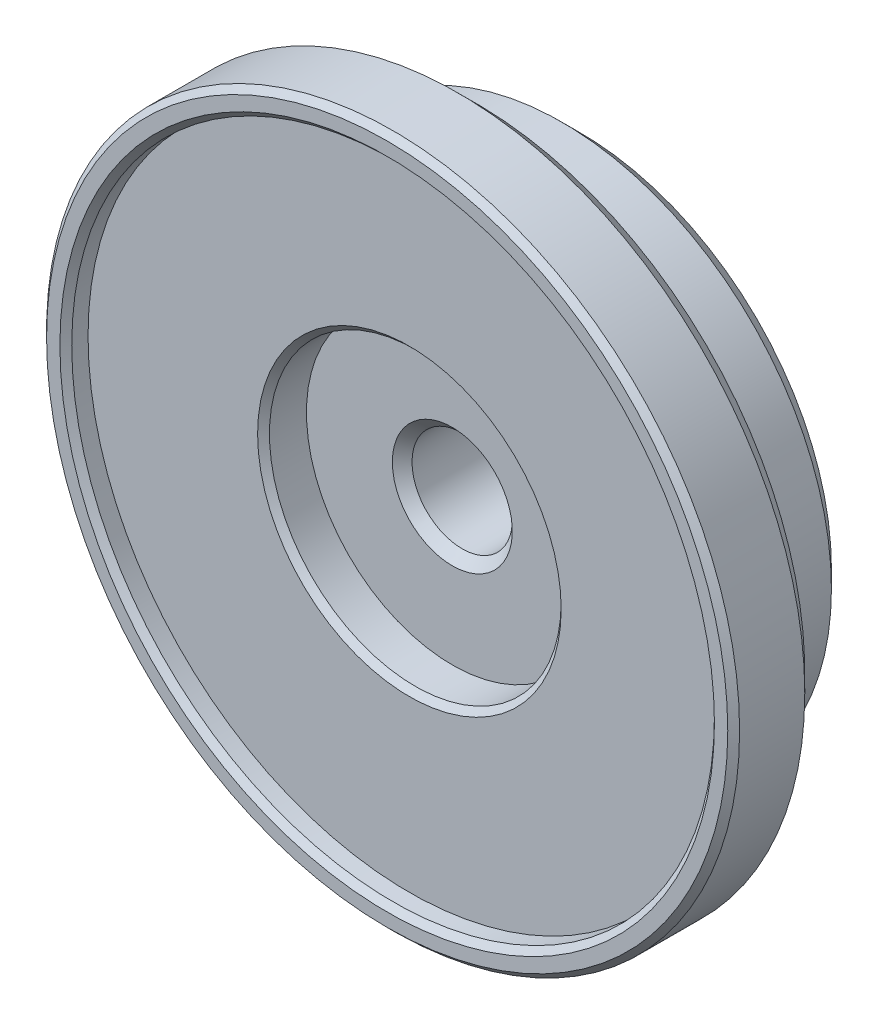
ISO-10303-21;
HEADER;
FILE_DESCRIPTION(('STEP AP214'),'2;1');
FILE_NAME('part.step','',(''),(''),'','','');
FILE_SCHEMA(('AUTOMOTIVE_DESIGN { 1 0 10303 214 1 1 1 1 }'));
ENDSEC;
DATA;
#1=APPLICATION_CONTEXT('core data for automotive mechanical design processes');
#2=APPLICATION_PROTOCOL_DEFINITION('international standard','automotive_design',2000,#1);
#3=PRODUCT_CONTEXT('',#1,'mechanical');
#4=PRODUCT('Part','Part','',(#3));
#5=PRODUCT_RELATED_PRODUCT_CATEGORY('part','',(#4));
#6=PRODUCT_DEFINITION_FORMATION('','',#4);
#7=PRODUCT_DEFINITION_CONTEXT('part definition',#1,'design');
#8=PRODUCT_DEFINITION('design','',#6,#7);
#9=PRODUCT_DEFINITION_SHAPE('','',#8);
#10=(LENGTH_UNIT() NAMED_UNIT(*) SI_UNIT(.MILLI.,.METRE.));
#11=(NAMED_UNIT(*) PLANE_ANGLE_UNIT() SI_UNIT($,.RADIAN.));
#12=(NAMED_UNIT(*) SI_UNIT($,.STERADIAN.) SOLID_ANGLE_UNIT());
#13=UNCERTAINTY_MEASURE_WITH_UNIT(LENGTH_MEASURE(1.E-05),#10,'distance_accuracy_value','');
#14=(GEOMETRIC_REPRESENTATION_CONTEXT(3) GLOBAL_UNCERTAINTY_ASSIGNED_CONTEXT((#13)) GLOBAL_UNIT_ASSIGNED_CONTEXT((#10,
#11,#12)) REPRESENTATION_CONTEXT('',''));
#15=CARTESIAN_POINT('',(0.,0.,0.));
#16=DIRECTION('',(0.,0.,1.));
#17=DIRECTION('',(1.,0.,0.));
#18=AXIS2_PLACEMENT_3D('',#15,#16,#17);
#19=CARTESIAN_POINT('',(0.,0.,-16.51));
#20=DIRECTION('',(0.,0.,1.));
#21=DIRECTION('',(1.,0.,0.));
#22=AXIS2_PLACEMENT_3D('',#19,#20,#21);
#23=CYLINDRICAL_SURFACE('',#22,29.718);
#24=CARTESIAN_POINT('',(0.,0.,-0.508000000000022));
#25=DIRECTION('',(0.,0.,1.));
#26=DIRECTION('',(1.,0.,0.));
#27=AXIS2_PLACEMENT_3D('',#24,#25,#26);
#28=CIRCLE('',#27,29.718);
#29=CARTESIAN_POINT('',(29.718,0.,-0.508000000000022));
#30=VERTEX_POINT('',#29);
#31=EDGE_CURVE('E32',#30,#30,#28,.F.);
#32=ORIENTED_EDGE('',*,*,#31,.T.);
#33=EDGE_LOOP('',(#32));
#34=FACE_BOUND('',#33,.T.);
#35=CARTESIAN_POINT('',(0.,0.,-6.09599999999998));
#36=DIRECTION('',(0.,0.,-1.));
#37=DIRECTION('',(-1.,0.,0.));
#38=AXIS2_PLACEMENT_3D('',#35,#36,#37);
#39=CIRCLE('',#38,29.718);
#40=CARTESIAN_POINT('',(-29.718,0.,-6.09599999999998));
#41=VERTEX_POINT('',#40);
#42=EDGE_CURVE('E57',#41,#41,#39,.F.);
#43=ORIENTED_EDGE('',*,*,#42,.T.);
#44=EDGE_LOOP('',(#43));
#45=FACE_BOUND('',#44,.T.);
#46=ADVANCED_FACE('F14',(#34,#45),#23,.T.);
#47=CARTESIAN_POINT('',(0.,0.,0.));
#48=DIRECTION('',(0.,0.,1.));
#49=DIRECTION('',(1.,0.,0.));
#50=AXIS2_PLACEMENT_3D('',#47,#48,#49);
#51=PLANE('',#50);
#52=CARTESIAN_POINT('',(0.,0.,0.));
#53=DIRECTION('',(0.,0.,1.));
#54=DIRECTION('',(1.,0.,0.));
#55=AXIS2_PLACEMENT_3D('',#52,#53,#54);
#56=CIRCLE('',#55,28.067);
#57=CARTESIAN_POINT('',(28.067,0.,0.));
#58=VERTEX_POINT('',#57);
#59=EDGE_CURVE('E93',#58,#58,#56,.F.);
#60=ORIENTED_EDGE('',*,*,#59,.T.);
#61=EDGE_LOOP('',(#60));
#62=FACE_BOUND('',#61,.T.);
#63=CARTESIAN_POINT('',(0.,0.,0.));
#64=DIRECTION('',(0.,0.,1.));
#65=DIRECTION('',(1.,0.,0.));
#66=AXIS2_PLACEMENT_3D('',#63,#64,#65);
#67=CIRCLE('',#66,29.21);
#68=CARTESIAN_POINT('',(29.21,0.,0.));
#69=VERTEX_POINT('',#68);
#70=EDGE_CURVE('E40',#69,#69,#67,.T.);
#71=ORIENTED_EDGE('',*,*,#70,.T.);
#72=EDGE_LOOP('',(#71));
#73=FACE_BOUND('',#72,.T.);
#74=ADVANCED_FACE('F131',(#62,#73),#51,.T.);
#75=CARTESIAN_POINT('',(0.,0.,-7.62));
#76=DIRECTION('',(0.,0.,-1.));
#77=DIRECTION('',(-1.,0.,0.));
#78=AXIS2_PLACEMENT_3D('',#75,#76,#77);
#79=PLANE('',#78);
#80=CARTESIAN_POINT('',(0.,0.,-7.62));
#81=DIRECTION('',(0.,0.,-1.));
#82=DIRECTION('',(-1.,0.,0.));
#83=AXIS2_PLACEMENT_3D('',#80,#81,#82);
#84=CIRCLE('',#83,23.876);
#85=CARTESIAN_POINT('',(-23.876,0.,-7.62));
#86=VERTEX_POINT('',#85);
#87=EDGE_CURVE('E9',#86,#86,#84,.F.);
#88=ORIENTED_EDGE('',*,*,#87,.T.);
#89=EDGE_LOOP('',(#88));
#90=FACE_BOUND('',#89,.T.);
#91=CARTESIAN_POINT('',(0.,0.,-7.62));
#92=DIRECTION('',(0.,0.,-1.));
#93=DIRECTION('',(-1.,0.,0.));
#94=AXIS2_PLACEMENT_3D('',#91,#92,#93);
#95=CIRCLE('',#94,28.194);
#96=CARTESIAN_POINT('',(-28.194,0.,-7.62));
#97=VERTEX_POINT('',#96);
#98=EDGE_CURVE('E54',#97,#97,#95,.T.);
#99=ORIENTED_EDGE('',*,*,#98,.T.);
#100=EDGE_LOOP('',(#99));
#101=FACE_BOUND('',#100,.T.);
#102=ADVANCED_FACE('F138',(#90,#101),#79,.T.);
#103=CARTESIAN_POINT('',(0.,0.,-7.62));
#104=DIRECTION('',(0.,0.,-1.));
#105=DIRECTION('',(-1.,0.,0.));
#106=AXIS2_PLACEMENT_3D('',#103,#104,#105);
#107=CYLINDRICAL_SURFACE('',#106,23.114);
#108=CARTESIAN_POINT('',(0.,0.,-8.382));
#109=DIRECTION('',(0.,0.,-1.));
#110=DIRECTION('',(-1.,0.,0.));
#111=AXIS2_PLACEMENT_3D('',#108,#109,#110);
#112=CIRCLE('',#111,23.114);
#113=CARTESIAN_POINT('',(-23.114,0.,-8.382));
#114=VERTEX_POINT('',#113);
#115=EDGE_CURVE('E22',#114,#114,#112,.T.);
#116=CARTESIAN_POINT('',(0.,0.,-14.9860000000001));
#117=DIRECTION('',(0.,0.,1.));
#118=DIRECTION('',(1.,0.,0.));
#119=AXIS2_PLACEMENT_3D('',#116,#117,#118);
#120=CIRCLE('',#119,23.114);
#121=CARTESIAN_POINT('',(-23.114,0.,-14.9860000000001));
#122=VERTEX_POINT('',#121);
#123=EDGE_CURVE('E46',#122,#122,#120,.T.);
#124=CARTESIAN_POINT('',(-23.114,0.,-8.382));
#125=CARTESIAN_POINT('',(-23.114,0.,-8.45079166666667));
#126=CARTESIAN_POINT('',(-23.114,0.,-8.51958333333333));
#127=CARTESIAN_POINT('',(-23.114,0.,-8.65716666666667));
#128=CARTESIAN_POINT('',(-23.114,0.,-8.72595833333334));
#129=CARTESIAN_POINT('',(-23.114,0.,-8.86354166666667));
#130=CARTESIAN_POINT('',(-23.114,0.,-8.93233333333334));
#131=CARTESIAN_POINT('',(-23.114,0.,-9.06991666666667));
#132=CARTESIAN_POINT('',(-23.114,0.,-9.13870833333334));
#133=CARTESIAN_POINT('',(-23.114,0.,-9.27629166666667));
#134=CARTESIAN_POINT('',(-23.114,0.,-9.34508333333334));
#135=CARTESIAN_POINT('',(-23.114,0.,-9.48266666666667));
#136=CARTESIAN_POINT('',(-23.114,0.,-9.55145833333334));
#137=CARTESIAN_POINT('',(-23.114,0.,-9.68904166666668));
#138=CARTESIAN_POINT('',(-23.114,0.,-9.75783333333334));
#139=CARTESIAN_POINT('',(-23.114,0.,-9.89541666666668));
#140=CARTESIAN_POINT('',(-23.114,0.,-9.96420833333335));
#141=CARTESIAN_POINT('',(-23.114,0.,-10.1017916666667));
#142=CARTESIAN_POINT('',(-23.114,0.,-10.1705833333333));
#143=CARTESIAN_POINT('',(-23.114,0.,-10.3081666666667));
#144=CARTESIAN_POINT('',(-23.114,0.,-10.3769583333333));
#145=CARTESIAN_POINT('',(-23.114,0.,-10.5145416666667));
#146=CARTESIAN_POINT('',(-23.114,0.,-10.5833333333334));
#147=CARTESIAN_POINT('',(-23.114,0.,-10.7209166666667));
#148=CARTESIAN_POINT('',(-23.114,0.,-10.7897083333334));
#149=CARTESIAN_POINT('',(-23.114,0.,-10.9272916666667));
#150=CARTESIAN_POINT('',(-23.114,0.,-10.9960833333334));
#151=CARTESIAN_POINT('',(-23.114,0.,-11.1336666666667));
#152=CARTESIAN_POINT('',(-23.114,0.,-11.2024583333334));
#153=CARTESIAN_POINT('',(-23.114,0.,-11.3400416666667));
#154=CARTESIAN_POINT('',(-23.114,0.,-11.4088333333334));
#155=CARTESIAN_POINT('',(-23.114,0.,-11.5464166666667));
#156=CARTESIAN_POINT('',(-23.114,0.,-11.6152083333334));
#157=CARTESIAN_POINT('',(-23.114,0.,-11.7527916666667));
#158=CARTESIAN_POINT('',(-23.114,0.,-11.8215833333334));
#159=CARTESIAN_POINT('',(-23.114,0.,-11.9591666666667));
#160=CARTESIAN_POINT('',(-23.114,0.,-12.0279583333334));
#161=CARTESIAN_POINT('',(-23.114,0.,-12.1655416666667));
#162=CARTESIAN_POINT('',(-23.114,0.,-12.2343333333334));
#163=CARTESIAN_POINT('',(-23.114,0.,-12.3719166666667));
#164=CARTESIAN_POINT('',(-23.114,0.,-12.4407083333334));
#165=CARTESIAN_POINT('',(-23.114,0.,-12.5782916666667));
#166=CARTESIAN_POINT('',(-23.114,0.,-12.6470833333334));
#167=CARTESIAN_POINT('',(-23.114,0.,-12.7846666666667));
#168=CARTESIAN_POINT('',(-23.114,0.,-12.8534583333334));
#169=CARTESIAN_POINT('',(-23.114,0.,-12.9910416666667));
#170=CARTESIAN_POINT('',(-23.114,0.,-13.0598333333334));
#171=CARTESIAN_POINT('',(-23.114,0.,-13.1974166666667));
#172=CARTESIAN_POINT('',(-23.114,0.,-13.2662083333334));
#173=CARTESIAN_POINT('',(-23.114,0.,-13.4037916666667));
#174=CARTESIAN_POINT('',(-23.114,0.,-13.4725833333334));
#175=CARTESIAN_POINT('',(-23.114,0.,-13.6101666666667));
#176=CARTESIAN_POINT('',(-23.114,0.,-13.6789583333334));
#177=CARTESIAN_POINT('',(-23.114,0.,-13.8165416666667));
#178=CARTESIAN_POINT('',(-23.114,0.,-13.8853333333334));
#179=CARTESIAN_POINT('',(-23.114,0.,-14.0229166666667));
#180=CARTESIAN_POINT('',(-23.114,0.,-14.0917083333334));
#181=CARTESIAN_POINT('',(-23.114,0.,-14.2292916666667));
#182=CARTESIAN_POINT('',(-23.114,0.,-14.2980833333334));
#183=CARTESIAN_POINT('',(-23.114,0.,-14.4356666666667));
#184=CARTESIAN_POINT('',(-23.114,0.,-14.5044583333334));
#185=CARTESIAN_POINT('',(-23.114,0.,-14.6420416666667));
#186=CARTESIAN_POINT('',(-23.114,0.,-14.7108333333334));
#187=CARTESIAN_POINT('',(-23.114,0.,-14.8484166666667));
#188=CARTESIAN_POINT('',(-23.114,0.,-14.9172083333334));
#189=CARTESIAN_POINT('',(-23.114,0.,-14.9860000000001));
#190=B_SPLINE_CURVE_WITH_KNOTS('',3,(#124,#125,#126,#127,#128,#129,#130,#131,#132,#133,#134,
#135,#136,#137,#138,#139,#140,#141,#142,#143,#144,#145,#146,#147,#148,#149,#150,#151,#152,#153,
#154,#155,#156,#157,#158,#159,#160,#161,#162,#163,#164,#165,#166,#167,#168,#169,#170,#171,#172,
#173,#174,#175,#176,#177,#178,#179,#180,#181,#182,#183,#184,#185,#186,#187,#188,#189),
.UNSPECIFIED.,.F.,.F.,(4,2,2,2,2,2,2,2,2,2,2,2,2,2,2,2,2,2,2,2,2,2,2,2,2,2,2,2,2,2,2,2,4),(0.,
0.206375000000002,0.412750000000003,0.619125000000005,0.825500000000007,1.03187500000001,
1.23825000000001,1.44462500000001,1.65100000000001,1.85737500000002,2.06375000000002,
2.27012500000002,2.47650000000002,2.68287500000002,2.88925000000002,3.09562500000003,
3.30200000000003,3.50837500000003,3.71475000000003,3.92112500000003,4.12750000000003,
4.33387500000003,4.54025000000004,4.74662500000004,4.95300000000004,5.15937500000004,
5.36575000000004,5.57212500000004,5.77850000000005,5.98487500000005,6.19125000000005,
6.39762500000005,6.60400000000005),.UNSPECIFIED.);
#191=EDGE_CURVE('BSEAM111',#114,#122,#190,.T.);
#192=ORIENTED_EDGE('',*,*,#115,.T.);
#193=ORIENTED_EDGE('',*,*,#123,.T.);
#194=ORIENTED_EDGE('',*,*,#191,.T.);
#195=ORIENTED_EDGE('',*,*,#191,.F.);
#196=EDGE_LOOP('',(#192,#194,#193,#195));
#197=FACE_BOUND('',#196,.T.);
#198=ADVANCED_FACE('F111',(#197),#107,.T.);
#199=CARTESIAN_POINT('',(0.,0.,-16.51));
#200=DIRECTION('',(0.,0.,1.));
#201=DIRECTION('',(1.,0.,0.));
#202=AXIS2_PLACEMENT_3D('',#199,#200,#201);
#203=PLANE('',#202);
#204=CARTESIAN_POINT('',(0.,0.,-16.51));
#205=DIRECTION('',(0.,0.,-1.));
#206=DIRECTION('',(-1.,0.,0.));
#207=AXIS2_PLACEMENT_3D('',#204,#205,#206);
#208=CIRCLE('',#207,5.1435);
#209=CARTESIAN_POINT('',(-5.1435,0.,-16.51));
#210=VERTEX_POINT('',#209);
#211=EDGE_CURVE('E97',#210,#210,#208,.T.);
#212=ORIENTED_EDGE('',*,*,#211,.F.);
#213=EDGE_LOOP('',(#212));
#214=FACE_BOUND('',#213,.T.);
#215=CARTESIAN_POINT('',(0.,0.,-16.51));
#216=DIRECTION('',(0.,0.,1.));
#217=DIRECTION('',(1.,0.,0.));
#218=AXIS2_PLACEMENT_3D('',#215,#216,#217);
#219=CIRCLE('',#218,21.59);
#220=CARTESIAN_POINT('',(21.59,0.,-16.51));
#221=VERTEX_POINT('',#220);
#222=EDGE_CURVE('E50',#221,#221,#219,.F.);
#223=ORIENTED_EDGE('',*,*,#222,.T.);
#224=EDGE_LOOP('',(#223));
#225=FACE_BOUND('',#224,.T.);
#226=ADVANCED_FACE('F107',(#214,#225),#203,.F.);
#227=CARTESIAN_POINT('',(0.,0.,-6.09599999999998));
#228=DIRECTION('',(0.,0.,1.));
#229=DIRECTION('',(1.,0.,0.));
#230=AXIS2_PLACEMENT_3D('',#227,#228,#229);
#231=CONICAL_SURFACE('',#230,29.718,0.785398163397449);
#232=ORIENTED_EDGE('',*,*,#98,.F.);
#233=EDGE_LOOP('',(#232));
#234=FACE_BOUND('',#233,.T.);
#235=ORIENTED_EDGE('',*,*,#42,.F.);
#236=EDGE_LOOP('',(#235));
#237=FACE_BOUND('',#236,.T.);
#238=ADVANCED_FACE('F110',(#234,#237),#231,.T.);
#239=CARTESIAN_POINT('',(0.,0.,-16.51));
#240=DIRECTION('',(0.,0.,1.));
#241=DIRECTION('',(1.,0.,0.));
#242=AXIS2_PLACEMENT_3D('',#239,#240,#241);
#243=CONICAL_SURFACE('',#242,21.59,0.785398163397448);
#244=ORIENTED_EDGE('',*,*,#123,.F.);
#245=EDGE_LOOP('',(#244));
#246=FACE_BOUND('',#245,.T.);
#247=ORIENTED_EDGE('',*,*,#222,.F.);
#248=EDGE_LOOP('',(#247));
#249=FACE_BOUND('',#248,.T.);
#250=ADVANCED_FACE('F115',(#246,#249),#243,.T.);
#251=CARTESIAN_POINT('',(0.,0.,0.));
#252=DIRECTION('',(0.,0.,-1.));
#253=DIRECTION('',(-1.,0.,0.));
#254=AXIS2_PLACEMENT_3D('',#251,#252,#253);
#255=CONICAL_SURFACE('',#254,29.21,0.785398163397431);
#256=ORIENTED_EDGE('',*,*,#31,.F.);
#257=EDGE_LOOP('',(#256));
#258=FACE_BOUND('',#257,.T.);
#259=ORIENTED_EDGE('',*,*,#70,.F.);
#260=EDGE_LOOP('',(#259));
#261=FACE_BOUND('',#260,.T.);
#262=ADVANCED_FACE('F117',(#258,#261),#255,.T.);
#263=CARTESIAN_POINT('',(0.,0.,-8.382));
#264=DIRECTION('',(0.,0.,-1.));
#265=DIRECTION('',(-1.,0.,0.));
#266=AXIS2_PLACEMENT_3D('',#263,#264,#265);
#267=TOROIDAL_SURFACE('',#266,23.876,0.762);
#268=ORIENTED_EDGE('',*,*,#87,.F.);
#269=EDGE_LOOP('',(#268));
#270=FACE_BOUND('',#269,.T.);
#271=ORIENTED_EDGE('',*,*,#115,.F.);
#272=EDGE_LOOP('',(#271));
#273=FACE_BOUND('',#272,.T.);
#274=ADVANCED_FACE('F16',(#270,#273),#267,.F.);
#275=CARTESIAN_POINT('',(0.,0.,-0.507999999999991));
#276=DIRECTION('',(0.,0.,1.));
#277=DIRECTION('',(1.,0.,0.));
#278=AXIS2_PLACEMENT_3D('',#275,#276,#277);
#279=CONICAL_SURFACE('',#278,27.559,0.785398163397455);
#280=ORIENTED_EDGE('',*,*,#59,.F.);
#281=EDGE_LOOP('',(#280));
#282=FACE_BOUND('',#281,.T.);
#283=CARTESIAN_POINT('',(0.,0.,-0.507999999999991));
#284=DIRECTION('',(0.,0.,1.));
#285=DIRECTION('',(1.,0.,0.));
#286=AXIS2_PLACEMENT_3D('',#283,#284,#285);
#287=CIRCLE('',#286,27.559);
#288=CARTESIAN_POINT('',(27.559,0.,-0.507999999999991));
#289=VERTEX_POINT('',#288);
#290=EDGE_CURVE('E85',#289,#289,#287,.T.);
#291=ORIENTED_EDGE('',*,*,#290,.F.);
#292=EDGE_LOOP('',(#291));
#293=FACE_BOUND('',#292,.T.);
#294=ADVANCED_FACE('F147',(#282,#293),#279,.F.);
#295=CARTESIAN_POINT('',(0.,0.,-16.51));
#296=DIRECTION('',(0.,0.,-1.));
#297=DIRECTION('',(-1.,0.,0.));
#298=AXIS2_PLACEMENT_3D('',#295,#296,#297);
#299=CONICAL_SURFACE('',#298,5.1435,0.78539816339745);
#300=CARTESIAN_POINT('',(0.,0.,-15.6665));
#301=DIRECTION('',(0.,0.,-1.));
#302=DIRECTION('',(-1.,0.,0.));
#303=AXIS2_PLACEMENT_3D('',#300,#301,#302);
#304=CIRCLE('',#303,4.3);
#305=CARTESIAN_POINT('',(-4.3,0.,-15.6665));
#306=VERTEX_POINT('',#305);
#307=EDGE_CURVE('E61',#306,#306,#304,.T.);
#308=ORIENTED_EDGE('',*,*,#307,.F.);
#309=EDGE_LOOP('',(#308));
#310=FACE_BOUND('',#309,.T.);
#311=ORIENTED_EDGE('',*,*,#211,.T.);
#312=EDGE_LOOP('',(#311));
#313=FACE_BOUND('',#312,.T.);
#314=ADVANCED_FACE('F105',(#310,#313),#299,.F.);
#315=CARTESIAN_POINT('',(0.,0.,-16.51));
#316=DIRECTION('',(0.,0.,-1.));
#317=DIRECTION('',(-1.,0.,0.));
#318=AXIS2_PLACEMENT_3D('',#315,#316,#317);
#319=CYLINDRICAL_SURFACE('',#318,4.3);
#320=CARTESIAN_POINT('',(0.,0.,-6.4315));
#321=DIRECTION('',(0.,0.,-1.));
#322=DIRECTION('',(-1.,0.,0.));
#323=AXIS2_PLACEMENT_3D('',#320,#321,#322);
#324=CIRCLE('',#323,4.3);
#325=CARTESIAN_POINT('',(-4.3,0.,-6.4315));
#326=VERTEX_POINT('',#325);
#327=EDGE_CURVE('E65',#326,#326,#324,.T.);
#328=ORIENTED_EDGE('',*,*,#327,.F.);
#329=EDGE_LOOP('',(#328));
#330=FACE_BOUND('',#329,.T.);
#331=ORIENTED_EDGE('',*,*,#307,.T.);
#332=EDGE_LOOP('',(#331));
#333=FACE_BOUND('',#332,.T.);
#334=ADVANCED_FACE('F153',(#330,#333),#319,.F.);
#335=CARTESIAN_POINT('',(0.,0.,-6.4315));
#336=DIRECTION('',(0.,0.,1.));
#337=DIRECTION('',(1.,0.,0.));
#338=AXIS2_PLACEMENT_3D('',#335,#336,#337);
#339=CONICAL_SURFACE('',#338,4.3,0.785398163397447);
#340=CARTESIAN_POINT('',(0.,0.,-5.588));
#341=DIRECTION('',(0.,0.,-1.));
#342=DIRECTION('',(-1.,0.,0.));
#343=AXIS2_PLACEMENT_3D('',#340,#341,#342);
#344=CIRCLE('',#343,5.1435);
#345=CARTESIAN_POINT('',(-5.1435,0.,-5.588));
#346=VERTEX_POINT('',#345);
#347=EDGE_CURVE('E69',#346,#346,#344,.T.);
#348=ORIENTED_EDGE('',*,*,#347,.F.);
#349=EDGE_LOOP('',(#348));
#350=FACE_BOUND('',#349,.T.);
#351=ORIENTED_EDGE('',*,*,#327,.T.);
#352=EDGE_LOOP('',(#351));
#353=FACE_BOUND('',#352,.T.);
#354=ADVANCED_FACE('F157',(#350,#353),#339,.F.);
#355=CARTESIAN_POINT('',(0.,0.,-5.588));
#356=DIRECTION('',(0.,0.,1.));
#357=DIRECTION('',(1.,0.,0.));
#358=AXIS2_PLACEMENT_3D('',#355,#356,#357);
#359=PLANE('',#358);
#360=ORIENTED_EDGE('',*,*,#347,.T.);
#361=EDGE_LOOP('',(#360));
#362=FACE_BOUND('',#361,.T.);
#363=CARTESIAN_POINT('',(0.,0.,-5.588));
#364=DIRECTION('',(0.,0.,1.));
#365=DIRECTION('',(1.,0.,0.));
#366=AXIS2_PLACEMENT_3D('',#363,#364,#365);
#367=CIRCLE('',#366,12.5095);
#368=CARTESIAN_POINT('',(12.5095,0.,-5.588));
#369=VERTEX_POINT('',#368);
#370=EDGE_CURVE('E73',#369,#369,#367,.T.);
#371=ORIENTED_EDGE('',*,*,#370,.T.);
#372=EDGE_LOOP('',(#371));
#373=FACE_BOUND('',#372,.T.);
#374=ADVANCED_FACE('F161',(#362,#373),#359,.T.);
#375=CARTESIAN_POINT('',(0.,0.,-5.588));
#376=DIRECTION('',(0.,0.,1.));
#377=DIRECTION('',(1.,0.,0.));
#378=AXIS2_PLACEMENT_3D('',#375,#376,#377);
#379=CYLINDRICAL_SURFACE('',#378,12.5095);
#380=CARTESIAN_POINT('',(0.,0.,-2.41299999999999));
#381=DIRECTION('',(0.,0.,1.));
#382=DIRECTION('',(1.,0.,0.));
#383=AXIS2_PLACEMENT_3D('',#380,#381,#382);
#384=CIRCLE('',#383,12.5095);
#385=CARTESIAN_POINT('',(12.5095,0.,-2.41299999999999));
#386=VERTEX_POINT('',#385);
#387=EDGE_CURVE('E77',#386,#386,#384,.T.);
#388=ORIENTED_EDGE('',*,*,#387,.T.);
#389=EDGE_LOOP('',(#388));
#390=FACE_BOUND('',#389,.T.);
#391=ORIENTED_EDGE('',*,*,#370,.F.);
#392=EDGE_LOOP('',(#391));
#393=FACE_BOUND('',#392,.T.);
#394=ADVANCED_FACE('F165',(#390,#393),#379,.F.);
#395=CARTESIAN_POINT('',(0.,0.,-1.905));
#396=DIRECTION('',(0.,0.,1.));
#397=DIRECTION('',(1.,0.,0.));
#398=AXIS2_PLACEMENT_3D('',#395,#396,#397);
#399=CONICAL_SURFACE('',#398,13.0175,0.785398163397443);
#400=ORIENTED_EDGE('',*,*,#387,.F.);
#401=EDGE_LOOP('',(#400));
#402=FACE_BOUND('',#401,.T.);
#403=CARTESIAN_POINT('',(0.,0.,-1.905));
#404=DIRECTION('',(0.,0.,1.));
#405=DIRECTION('',(1.,0.,0.));
#406=AXIS2_PLACEMENT_3D('',#403,#404,#405);
#407=CIRCLE('',#406,13.0175);
#408=CARTESIAN_POINT('',(13.0175,0.,-1.905));
#409=VERTEX_POINT('',#408);
#410=EDGE_CURVE('E81',#409,#409,#407,.F.);
#411=ORIENTED_EDGE('',*,*,#410,.F.);
#412=EDGE_LOOP('',(#411));
#413=FACE_BOUND('',#412,.T.);
#414=ADVANCED_FACE('F169',(#402,#413),#399,.F.);
#415=CARTESIAN_POINT('',(0.,0.,-1.905));
#416=DIRECTION('',(0.,0.,1.));
#417=DIRECTION('',(1.,0.,0.));
#418=AXIS2_PLACEMENT_3D('',#415,#416,#417);
#419=PLANE('',#418);
#420=ORIENTED_EDGE('',*,*,#410,.T.);
#421=EDGE_LOOP('',(#420));
#422=FACE_BOUND('',#421,.T.);
#423=CARTESIAN_POINT('',(0.,0.,-1.905));
#424=DIRECTION('',(0.,0.,1.));
#425=DIRECTION('',(1.,0.,0.));
#426=AXIS2_PLACEMENT_3D('',#423,#424,#425);
#427=CIRCLE('',#426,27.559);
#428=CARTESIAN_POINT('',(27.559,0.,-1.905));
#429=VERTEX_POINT('',#428);
#430=EDGE_CURVE('E89',#429,#429,#427,.F.);
#431=ORIENTED_EDGE('',*,*,#430,.F.);
#432=EDGE_LOOP('',(#431));
#433=FACE_BOUND('',#432,.T.);
#434=ADVANCED_FACE('F173',(#422,#433),#419,.T.);
#435=CARTESIAN_POINT('',(0.,0.,-4.699));
#436=DIRECTION('',(0.,0.,1.));
#437=DIRECTION('',(1.,0.,0.));
#438=AXIS2_PLACEMENT_3D('',#435,#436,#437);
#439=CYLINDRICAL_SURFACE('',#438,27.559);
#440=ORIENTED_EDGE('',*,*,#430,.T.);
#441=EDGE_LOOP('',(#440));
#442=FACE_BOUND('',#441,.T.);
#443=ORIENTED_EDGE('',*,*,#290,.T.);
#444=EDGE_LOOP('',(#443));
#445=FACE_BOUND('',#444,.T.);
#446=ADVANCED_FACE('F177',(#442,#445),#439,.F.);
#447=CLOSED_SHELL('',(#46,#74,#102,#198,#226,#238,#250,#262,#274,#294,#314,#334,#354,#374,#394,
#414,#434,#446));
#448=MANIFOLD_SOLID_BREP('B1',#447);
#449=ADVANCED_BREP_SHAPE_REPRESENTATION('',(#18,#448),#14);
#450=SHAPE_DEFINITION_REPRESENTATION(#9,#449);
ENDSEC;
END-ISO-10303-21;
